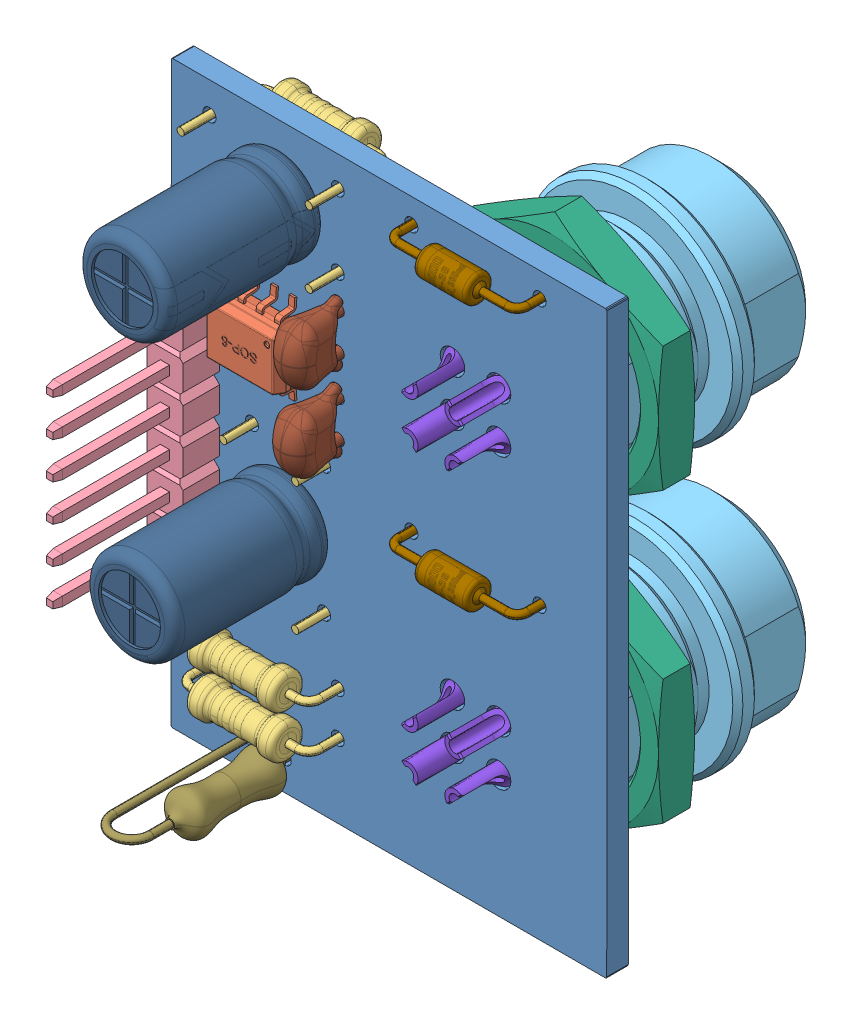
SolidWorks assembly PCB.sldasm, configuration Default (file format 4400). Lengths in mm.
Overall size (30.22 40.22 28.24).
53 component instances, 13 part files, 0 mates.
Components (placement in the parent):
- Board-1: Board.sldprt [Default] at (0 0 -1.4914) size (30.22 40.22 1.49)
- U1-1: U1.sldasm [Default] at origin size (5 6.22 1.89)
  - SOP-8-1: SOP-8.sldprt [Default] at (6.5 27 0) x (-1 0 0) z (0 1 0) size (5 1.89 6.22)
- R6-1: R6.sldasm [Default] at origin size (9.39 2.4 6.7)
  - RES_AH_0.25W_350mil_0R_1%-1: RES_AH_0.25W_350mil_0R_1%.sldprt [Default] at (7 33 -3.4914) x (1 0 0) z (0 1 0) size (9.39 6.7 2.4)
- R5-1: R5.sldasm [Default] at origin size (9.39 2.4 6.7)
  - RES_AH_0.25W_350mil_0R_1%-1: RES_AH_0.25W_350mil_0R_1%.sldprt [Default] at (7 38 -3.4914) x (1 0 0) z (0 1 0) size (9.39 6.7 2.4)
- R4-1: R4.sldasm [Default] at origin size (2.4 9.39 6.7)
  - RES_AH_0.25W_350mil_0R_1%-1: RES_AH_0.25W_350mil_0R_1%.sldprt [Default] at (10.5 16.5 -3.4914) x (0 1 0) z (-1 0 0) size (9.39 6.7 2.4)
- R3-1: R3.sldasm [Default] at origin size (2.4 9.39 6.7)
  - RES_AH_0.25W_350mil_0R_1%-1: RES_AH_0.25W_350mil_0R_1%.sldprt [Default] at (5.5 16.5 -3.4914) x (0 1 0) z (-1 0 0) size (9.39 6.7 2.4)
- R2-1: R2.sldasm [Default] at origin size (9.39 2.4 6.7)
  - RES_AH_0.25W_350mil_0R_1%-1: RES_AH_0.25W_350mil_0R_1%.sldprt [Default] at (7 8 2) x (1 0 0) z (0 -1 0) size (9.39 6.7 2.4)
- R1-1: R1.sldasm [Default] at origin size (9.39 2.4 6.7)
  - RES_AH_0.25W_350mil_0R_1%-1: RES_AH_0.25W_350mil_0R_1%.sldprt [Default] at (7 5 2) x (1 0 0) z (0 -1 0) size (9.39 6.7 2.4)
- J3-1: J3.sldasm [Default] at origin size (2.5 15.25 13.54)
  - 1x6_Male_Pin_Header-1: 1x6_Male_Pin_Header.sldprt [Default] at (1.9999 13.6501 0) x (0 1 0) z (1 0 0) size (15.24 13.54 2.5)
- J2-1: J2.sldasm [Default] at origin size (15 17.32 20.25)
  - GX12-4_Jack-1: GX12-4_Jack.sldasm [Default] at (21 30 -10.6914) x (0 0 1) z (1 0 0) size (20.25 17.32 15)
    - Body-1: Body.sldprt [Default] at origin size (15.6 15 15)
    - Body001-1: Body001.sldprt [Default] at (3 0 0) size (2.5 17.32 15)
    - Body002-1: Body002.sldprt [Default] at origin size (5.15 9.54 9.6)
    - Body004-1: Body004.sldprt [Default] at origin size (1 13 13)
    - Array-1: Array.sldasm [Default] at origin size (18.75 6.08 6.08)
      - Body003-1: Body003.sldprt [Default] at (0 1.6263 1.6263) x (1 0 0) z (0 -0.707107 0.707107) size (18.75 2 2)
      - Body003-2: Body003.sldprt [Default] at (0 -1.6263 1.6263) x (1 0 0) z (0 -0.707107 -0.707107) size (18.75 2 2)
      - Body003-3: Body003.sldprt [Default] at (0 -1.6263 -1.6263) x (1 0 0) z (0 0.707107 -0.707107) size (18.75 2 2)
      - Body003-4: Body003.sldprt [Default] at (0 1.6263 -1.6263) x (1 0 0) z (0 0.707107 0.707107) size (18.75 2 2)
- J1-1: J1.sldasm [Default] at origin size (15 17.32 20.25)
  - GX12-4_Jack-1: GX12-4_Jack.sldasm [Default] at (21 10 -10.6914) x (0 0 1) z (1 0 0) size (20.25 17.32 15)
    - Body-1: Body.sldprt [Default] at origin size (15.6 15 15)
    - Body001-1: Body001.sldprt [Default] at (3 0 0) size (2.5 17.32 15)
    - Body002-1: Body002.sldprt [Default] at origin size (5.15 9.54 9.6)
    - Body004-1: Body004.sldprt [Default] at origin size (1 13 13)
    - Array-1: Array.sldasm [Default] at origin size (18.75 6.08 6.08)
      - Body003-1: Body003.sldprt [Default] at (0 1.6263 1.6263) x (1 0 0) z (0 -0.707107 0.707107) size (18.75 2 2)
      - Body003-2: Body003.sldprt [Default] at (0 -1.6263 1.6263) x (1 0 0) z (0 -0.707107 -0.707107) size (18.75 2 2)
      - Body003-3: Body003.sldprt [Default] at (0 -1.6263 -1.6263) x (1 0 0) z (0 0.707107 -0.707107) size (18.75 2 2)
      - Body003-4: Body003.sldprt [Default] at (0 1.6263 -1.6263) x (1 0 0) z (0 0.707107 0.707107) size (18.75 2 2)
- D2-1: D2.sldasm [Default] at origin size (9.4 1.91 5.01)
  - DO-35_Normal_350mil_rev1.1-1: DO-35_Normal_350mil_rev1.1.sldprt [Default] at (25.4451 38.4127 0.1) x (-1 0 0) z (0 1 0) size (9.4 5.01 1.91)
- D1-1: D1.sldasm [Default] at origin size (9.4 1.91 5.01)
  - DO-35_Normal_350mil_rev1.1-1: DO-35_Normal_350mil_rev1.1.sldprt [Default] at (25.4451 20.0127 0.1) x (-1 0 0) z (0 1 0) size (9.4 5.01 1.91)
- C4-1: C4.sldasm [Default] at origin size (6.44 6.3 14.25)
  - CAPPRD250W50D630H1100-1: CAPPRD250W50D630H1100.sldprt [Default] at (7.5001 35.5001 0) x (1 0 0) z (0 0 1) size (6.44 6.3 14.25)
- C3-1: C3.sldasm [Default] at origin size (2.47 4.63 6.02)
  - Ceramic_Cap,_2.54mm_lead_spacing,_4mm_width,_and_5_5mm_tall,_v4_v2-1: Ceramic_Cap,_2.54mm_lead_spacing,_4mm_width,_and_5_5mm_tall,_v4_v2.sldprt [Default] at (12.7767 31.5349 0) x (0 -1 0) z (-1 0 0) size (4.63 6.02 2.47)
- C2-1: C2.sldasm [Default] at origin size (2.47 4.63 6.02)
  - Ceramic_Cap,_2.54mm_lead_spacing,_4mm_width,_and_5_5mm_tall,_v4_v2-1: Ceramic_Cap,_2.54mm_lead_spacing,_4mm_width,_and_5_5mm_tall,_v4_v2.sldprt [Default] at (10.2233 22.2151 0) x (0 1 0) z (1 0 0) size (4.63 6.02 2.47)
- C1-1: C1.sldasm [Default] at origin size (6.3 6.44 14.25)
  - CAPPRD250W50D630H1100-1: CAPPRD250W50D630H1100.sldprt [Default] at (8.0001 16.4999 0) x (0 -1 0) z (0 0 1) size (6.44 6.3 14.25)
- F1-1: F1.sldasm [Default] at origin size (4.2 2.83 13.45)
  - FUS_AV_type_251_100mil-1: FUS_AV_type_251_100mil.sldprt [Default] at (7.7701 2.0001 4) x (1 0 0) z (0 -1 0) size (4.2 13.45 2.83)
